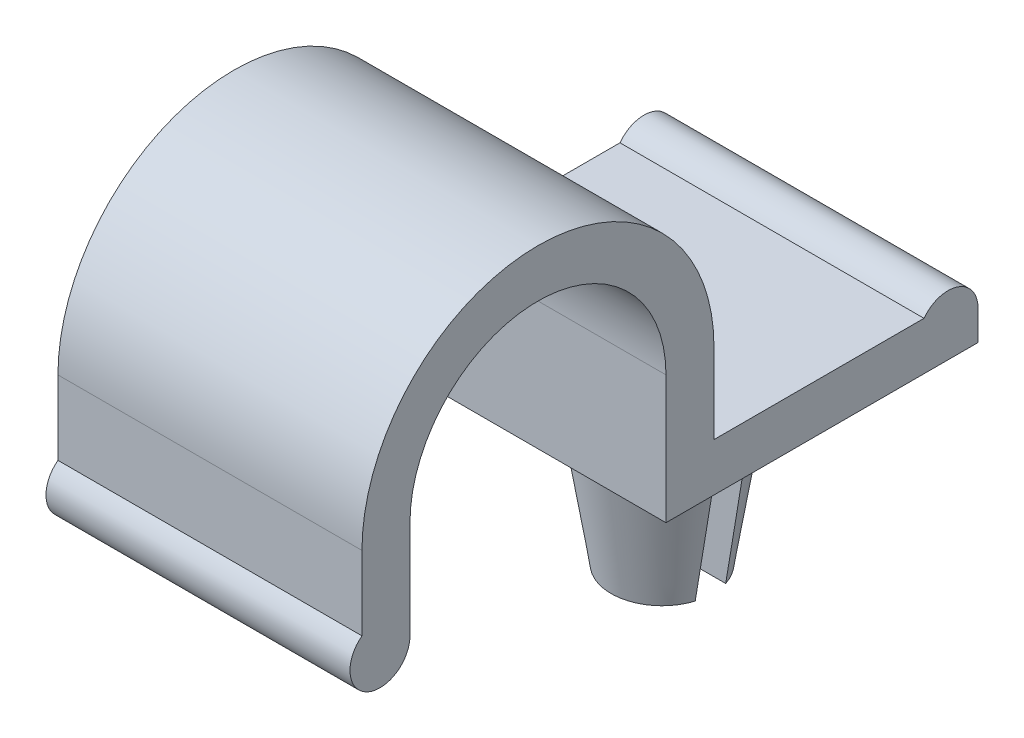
from build123d import *

# Parameters (mm, degrees)
BASE_EXTRUDE_DEPTH      = 3.8
CUT_EXTRUDE1_DEPTH      = 15.038454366
CUT_EXTRUDE1_DEPTH_BACK = 15.038454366


with BuildPart() as part:
    # Sketch1 → Base-Extrude (new, symmetric)
    with BuildSketch(Plane.ZY):
        with BuildLine():
            Line((-9.65, -2), (-4.4, -2))
            Line((-4.4, -2), (-4.4, 0))
            ThreePointArc((-4.4, 0), (0, 4.4), (4.4, 0))
            Line((4.4, 0), (4.4, -1.85))
            ThreePointArc((4.4, -1.85), (4.285410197, -3.120820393), (3.2, -2.45))
            Line((3.2, -2.45), (3.2, 0))
            ThreePointArc((3.2, 0), (0, 3.2), (-3.2, 0))
            Line((-3.2, 0), (-3.2, -3.2))
            Line((-3.2, -3.2), (-11, -3.2))
            Line((-11, -3.2), (-11, -2.45))
            ThreePointArc((-11, -2.45), (-10.487170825, -1.738487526), (-9.65, -2))
        make_face()
    extrude(amount=BASE_EXTRUDE_DEPTH, both=True)

    # Sketch4 → Boss-Revolve1 (revolve)
    with BuildSketch(Plane.ZY, mode=Mode.PRIVATE) as boss_revolve1_sk:
        Polygon((-6.9, -3.2), (-6.9, -7.851), (-5.63, -7.851), (-5.15, -4.851), (-5.4, -4.851), (-5.4, -3.2), align=None)
    revolve(boss_revolve1_sk.sketch.rotate(Axis((0, -3.2, -6.9), (0, 1, 0)), 180), axis=Axis((0, -3.2, -6.9), (0, 1, 0)))

    # Sketch5 → Cut-Extrude1 (cut, two sides: drawn at the far end of the back side and taken through both)
    with BuildSketch(Plane.ZY.offset(-CUT_EXTRUDE1_DEPTH_BACK)):
        with BuildLine():
            Line((-7.281, -7.851), (-6.519, -7.851))
            Line((-6.519, -7.851), (-6.519, -3.787))
            ThreePointArc((-6.519, -3.787), (-6.9, -3.406), (-7.281, -3.787))
            Line((-7.281, -3.787), (-7.281, -7.851))
        make_face()
    extrude(amount=CUT_EXTRUDE1_DEPTH + CUT_EXTRUDE1_DEPTH_BACK, mode=Mode.SUBTRACT)


solid = part.part
